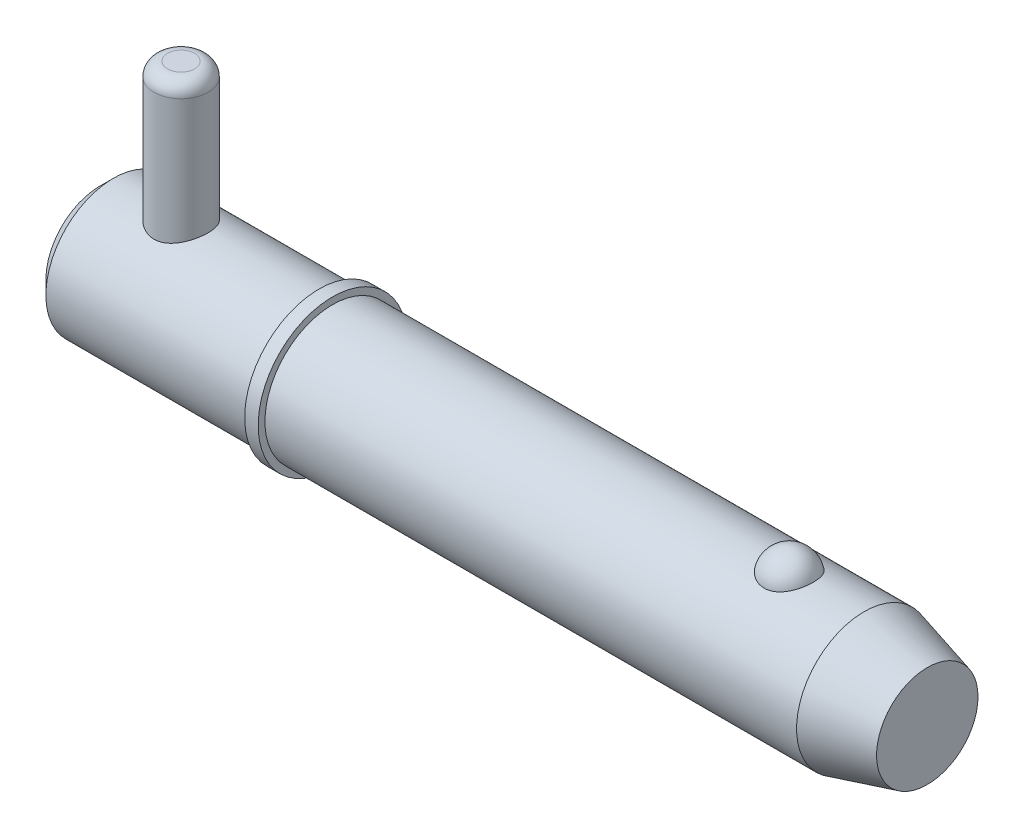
ISO-10303-21;
HEADER;
FILE_DESCRIPTION(('STEP AP214'),'2;1');
FILE_NAME('part.step','',(''),(''),'','','');
FILE_SCHEMA(('AUTOMOTIVE_DESIGN { 1 0 10303 214 1 1 1 1 }'));
ENDSEC;
DATA;
#1=APPLICATION_CONTEXT('core data for automotive mechanical design processes');
#2=APPLICATION_PROTOCOL_DEFINITION('international standard','automotive_design',2000,#1);
#3=PRODUCT_CONTEXT('',#1,'mechanical');
#4=PRODUCT('Part','Part','',(#3));
#5=PRODUCT_RELATED_PRODUCT_CATEGORY('part','',(#4));
#6=PRODUCT_DEFINITION_FORMATION('','',#4);
#7=PRODUCT_DEFINITION_CONTEXT('part definition',#1,'design');
#8=PRODUCT_DEFINITION('design','',#6,#7);
#9=PRODUCT_DEFINITION_SHAPE('','',#8);
#10=(LENGTH_UNIT() NAMED_UNIT(*) SI_UNIT(.MILLI.,.METRE.));
#11=(NAMED_UNIT(*) PLANE_ANGLE_UNIT() SI_UNIT($,.RADIAN.));
#12=(NAMED_UNIT(*) SI_UNIT($,.STERADIAN.) SOLID_ANGLE_UNIT());
#13=UNCERTAINTY_MEASURE_WITH_UNIT(LENGTH_MEASURE(1.E-05),#10,'distance_accuracy_value','');
#14=(GEOMETRIC_REPRESENTATION_CONTEXT(3) GLOBAL_UNCERTAINTY_ASSIGNED_CONTEXT((#13)) GLOBAL_UNIT_ASSIGNED_CONTEXT((#10,
#11,#12)) REPRESENTATION_CONTEXT('',''));
#15=CARTESIAN_POINT('',(0.,0.,0.));
#16=DIRECTION('',(0.,0.,1.));
#17=DIRECTION('',(1.,0.,0.));
#18=AXIS2_PLACEMENT_3D('',#15,#16,#17);
#19=CARTESIAN_POINT('',(9.525,23.81,0.));
#20=DIRECTION('',(0.,-1.,0.));
#21=DIRECTION('',(0.,0.,-1.));
#22=AXIS2_PLACEMENT_3D('',#19,#20,#21);
#23=CYLINDRICAL_SURFACE('',#22,3.175);
#24=CARTESIAN_POINT('',(9.525,-6.3525,0.));
#25=DIRECTION('',(0.,1.,0.));
#26=DIRECTION('',(0.,0.,1.));
#27=AXIS2_PLACEMENT_3D('',#24,#25,#26);
#28=CIRCLE('',#27,3.175);
#29=CARTESIAN_POINT('',(9.525,-6.3525,3.175));
#30=VERTEX_POINT('',#29);
#31=EDGE_CURVE('P0_E25',#30,#30,#28,.T.);
#32=ORIENTED_EDGE('',*,*,#31,.T.);
#33=EDGE_LOOP('',(#32));
#34=FACE_BOUND('',#33,.T.);
#35=CARTESIAN_POINT('',(9.525,22.2225,0.));
#36=DIRECTION('',(0.,1.,0.));
#37=DIRECTION('',(0.,0.,1.));
#38=AXIS2_PLACEMENT_3D('',#35,#36,#37);
#39=CIRCLE('',#38,3.175);
#40=CARTESIAN_POINT('',(9.525,22.2225,3.175));
#41=VERTEX_POINT('',#40);
#42=EDGE_CURVE('P0_E29',#41,#41,#39,.F.);
#43=ORIENTED_EDGE('',*,*,#42,.T.);
#44=EDGE_LOOP('',(#43));
#45=FACE_BOUND('',#44,.T.);
#46=ADVANCED_FACE('P0_F14',(#34,#45),#23,.T.);
#47=CARTESIAN_POINT('',(9.525,23.81,0.));
#48=DIRECTION('',(0.,1.,0.));
#49=DIRECTION('',(0.,0.,1.));
#50=AXIS2_PLACEMENT_3D('',#47,#48,#49);
#51=PLANE('',#50);
#52=CARTESIAN_POINT('',(9.525,23.81,0.));
#53=DIRECTION('',(0.,1.,0.));
#54=DIRECTION('',(0.,0.,1.));
#55=AXIS2_PLACEMENT_3D('',#52,#53,#54);
#56=CIRCLE('',#55,1.5875);
#57=CARTESIAN_POINT('',(9.525,23.81,1.5875));
#58=VERTEX_POINT('',#57);
#59=EDGE_CURVE('P0_E10',#58,#58,#56,.T.);
#60=ORIENTED_EDGE('',*,*,#59,.T.);
#61=EDGE_LOOP('',(#60));
#62=FACE_BOUND('',#61,.T.);
#63=ADVANCED_FACE('P0_F46',(#62),#51,.T.);
#64=CARTESIAN_POINT('',(9.525,-7.94,0.));
#65=DIRECTION('',(0.,1.,0.));
#66=DIRECTION('',(0.,0.,1.));
#67=AXIS2_PLACEMENT_3D('',#64,#65,#66);
#68=PLANE('',#67);
#69=CARTESIAN_POINT('',(9.525,-7.94,0.));
#70=DIRECTION('',(0.,1.,0.));
#71=DIRECTION('',(0.,0.,1.));
#72=AXIS2_PLACEMENT_3D('',#69,#70,#71);
#73=CIRCLE('',#72,1.5875);
#74=CARTESIAN_POINT('',(9.525,-7.94,1.5875));
#75=VERTEX_POINT('',#74);
#76=EDGE_CURVE('P0_E21',#75,#75,#73,.F.);
#77=ORIENTED_EDGE('',*,*,#76,.T.);
#78=EDGE_LOOP('',(#77));
#79=FACE_BOUND('',#78,.T.);
#80=ADVANCED_FACE('P0_F43',(#79),#68,.F.);
#81=CARTESIAN_POINT('',(9.525,-6.3525,0.));
#82=DIRECTION('',(0.,1.,0.));
#83=DIRECTION('',(0.,0.,1.));
#84=AXIS2_PLACEMENT_3D('',#81,#82,#83);
#85=DEGENERATE_TOROIDAL_SURFACE('',#84,1.5875,1.5875,.T.);
#86=ORIENTED_EDGE('',*,*,#76,.F.);
#87=EDGE_LOOP('',(#86));
#88=FACE_BOUND('',#87,.T.);
#89=ORIENTED_EDGE('',*,*,#31,.F.);
#90=EDGE_LOOP('',(#89));
#91=FACE_BOUND('',#90,.T.);
#92=ADVANCED_FACE('P0_F38',(#88,#91),#85,.T.);
#93=CARTESIAN_POINT('',(9.525,22.2225,0.));
#94=DIRECTION('',(0.,1.,0.));
#95=DIRECTION('',(0.,0.,1.));
#96=AXIS2_PLACEMENT_3D('',#93,#94,#95);
#97=DEGENERATE_TOROIDAL_SURFACE('',#96,1.5875,1.5875,.T.);
#98=ORIENTED_EDGE('',*,*,#42,.F.);
#99=EDGE_LOOP('',(#98));
#100=FACE_BOUND('',#99,.T.);
#101=ORIENTED_EDGE('',*,*,#59,.F.);
#102=EDGE_LOOP('',(#101));
#103=FACE_BOUND('',#102,.T.);
#104=ADVANCED_FACE('P0_F16',(#100,#103),#97,.T.);
#105=CLOSED_SHELL('',(#46,#63,#80,#92,#104));
#106=MANIFOLD_SOLID_BREP('P0_B1',#105);
#107=CARTESIAN_POINT('',(0.,0.,0.));
#108=DIRECTION('',(1.,0.,0.));
#109=DIRECTION('',(0.,0.,-1.));
#110=AXIS2_PLACEMENT_3D('',#107,#108,#109);
#111=CYLINDRICAL_SURFACE('',#110,7.94);
#112=CARTESIAN_POINT('',(89.7518791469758,0.,0.));
#113=DIRECTION('',(1.,0.,0.));
#114=DIRECTION('',(0.,0.,-1.));
#115=AXIS2_PLACEMENT_3D('',#112,#113,#114);
#116=CIRCLE('',#115,7.94);
#117=CARTESIAN_POINT('',(89.7518791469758,0.,-7.94));
#118=VERTEX_POINT('',#117);
#119=EDGE_CURVE('P1_E81',#118,#118,#116,.T.);
#120=ORIENTED_EDGE('',*,*,#119,.F.);
#121=EDGE_LOOP('',(#120));
#122=FACE_BOUND('',#121,.T.);
#123=CARTESIAN_POINT('',(27.31,0.,0.));
#124=DIRECTION('',(1.,0.,0.));
#125=DIRECTION('',(0.,0.,-1.));
#126=AXIS2_PLACEMENT_3D('',#123,#124,#125);
#127=CIRCLE('',#126,7.94);
#128=CARTESIAN_POINT('',(27.31,0.,-7.94));
#129=VERTEX_POINT('',#128);
#130=EDGE_CURVE('P1_E85',#129,#129,#127,.T.);
#131=ORIENTED_EDGE('',*,*,#130,.T.);
#132=EDGE_LOOP('',(#131));
#133=FACE_BOUND('',#132,.T.);
#134=CARTESIAN_POINT('',(80.9449074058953,7.37767842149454,2.93486986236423));
#135=CARTESIAN_POINT('',(80.7927496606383,7.3776732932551,2.93487505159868));
#136=CARTESIAN_POINT('',(80.6406329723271,7.38258419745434,2.92262454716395));
#137=CARTESIAN_POINT('',(80.3409284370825,7.40163229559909,2.87404196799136));
#138=CARTESIAN_POINT('',(80.1933394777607,7.41576720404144,2.83771585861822));
#139=CARTESIAN_POINT('',(79.9070187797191,7.4516157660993,2.74218769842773));
#140=CARTESIAN_POINT('',(79.7682745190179,7.47331841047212,2.68301886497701));
#141=CARTESIAN_POINT('',(79.5028822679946,7.52194082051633,2.54350967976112));
#142=CARTESIAN_POINT('',(79.3762366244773,7.5488615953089,2.46316523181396));
#143=CARTESIAN_POINT('',(79.1345349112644,7.60594671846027,2.28090375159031));
#144=CARTESIAN_POINT('',(79.0199065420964,7.63618114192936,2.17844211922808));
#145=CARTESIAN_POINT('',(78.8088787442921,7.69614046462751,1.95608495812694));
#146=CARTESIAN_POINT('',(78.7124826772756,7.72586526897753,1.83618622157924));
#147=CARTESIAN_POINT('',(78.5359381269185,7.78314821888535,1.57628086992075));
#148=CARTESIAN_POINT('',(78.4567072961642,7.81055035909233,1.43561546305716));
#149=CARTESIAN_POINT('',(78.3217979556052,7.85879631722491,1.14236334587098));
#150=CARTESIAN_POINT('',(78.2661216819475,7.87963951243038,0.989775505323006));
#151=CARTESIAN_POINT('',(78.1788121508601,7.91289645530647,0.67461992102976));
#152=CARTESIAN_POINT('',(78.1475309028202,7.925186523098,0.511941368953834));
#153=CARTESIAN_POINT('',(78.110975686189,7.93958930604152,0.183247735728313));
#154=CARTESIAN_POINT('',(78.1057012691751,7.94170219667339,0.0172327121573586));
#155=CARTESIAN_POINT('',(78.1212311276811,7.93554931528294,-0.312672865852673));
#156=CARTESIAN_POINT('',(78.1419253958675,7.92732732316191,-0.476569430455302));
#157=CARTESIAN_POINT('',(78.2087865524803,7.90141534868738,-0.798305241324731));
#158=CARTESIAN_POINT('',(78.2549539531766,7.88372517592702,-0.956144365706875));
#159=CARTESIAN_POINT('',(78.3718986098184,7.84066230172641,-1.26152073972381));
#160=CARTESIAN_POINT('',(78.4427046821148,7.81528060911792,-1.40904568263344));
#161=CARTESIAN_POINT('',(78.6074789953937,7.7594867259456,-1.68950598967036));
#162=CARTESIAN_POINT('',(78.7014488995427,7.72907417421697,-1.82244030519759));
#163=CARTESIAN_POINT('',(78.9108391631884,7.66640424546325,-2.07032792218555));
#164=CARTESIAN_POINT('',(79.0263152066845,7.63414223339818,-2.1852330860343));
#165=CARTESIAN_POINT('',(79.2759006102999,7.57149681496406,-2.39329737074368));
#166=CARTESIAN_POINT('',(79.4100080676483,7.54111321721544,-2.48645870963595));
#167=CARTESIAN_POINT('',(79.6901113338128,7.48650742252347,-2.64628132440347));
#168=CARTESIAN_POINT('',(79.8357605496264,7.46215900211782,-2.71350554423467));
#169=CARTESIAN_POINT('',(80.1374259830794,7.42171253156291,-2.82226614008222));
#170=CARTESIAN_POINT('',(80.2934383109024,7.40561140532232,-2.86381209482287));
#171=CARTESIAN_POINT('',(80.6029708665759,7.3842679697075,-2.91839077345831));
#172=CARTESIAN_POINT('',(80.7562229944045,7.37852109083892,-2.93275024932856));
#173=CARTESIAN_POINT('',(81.0630705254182,7.37700973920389,-2.93655208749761));
#174=CARTESIAN_POINT('',(81.2166658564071,7.38124333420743,-2.92599927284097));
#175=CARTESIAN_POINT('',(81.5149907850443,7.39890635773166,-2.88102897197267));
#176=CARTESIAN_POINT('',(81.6598480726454,7.41205491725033,-2.8473399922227));
#177=CARTESIAN_POINT('',(81.9416432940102,7.445801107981,-2.75788206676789));
#178=CARTESIAN_POINT('',(82.0785805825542,7.46639934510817,-2.70211132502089));
#179=CARTESIAN_POINT('',(82.3440619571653,7.51339098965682,-2.56858908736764));
#180=CARTESIAN_POINT('',(82.4723548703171,7.53990200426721,-2.49038067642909));
#181=CARTESIAN_POINT('',(82.7142440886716,7.59569503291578,-2.31462737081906));
#182=CARTESIAN_POINT('',(82.8278370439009,7.62497767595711,-2.21707808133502));
#183=CARTESIAN_POINT('',(83.04322156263,7.68489473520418,-1.99982049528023));
#184=CARTESIAN_POINT('',(83.1441488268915,7.71552419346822,-1.87925337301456));
#185=CARTESIAN_POINT('',(83.3251866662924,7.77353016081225,-1.62268826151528));
#186=CARTESIAN_POINT('',(83.4052934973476,7.80090608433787,-1.4866875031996));
#187=CARTESIAN_POINT('',(83.5453615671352,7.85047992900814,-1.19818413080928));
#188=CARTESIAN_POINT('',(83.6045877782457,7.8724818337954,-1.04529016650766));
#189=CARTESIAN_POINT('',(83.6979821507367,7.90785114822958,-0.731080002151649));
#190=CARTESIAN_POINT('',(83.7321497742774,7.92121837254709,-0.569763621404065));
#191=CARTESIAN_POINT('',(83.774795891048,7.93797834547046,-0.242812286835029));
#192=CARTESIAN_POINT('',(83.7832047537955,7.94134405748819,-0.0771668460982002));
#193=CARTESIAN_POINT('',(83.7739626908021,7.93767937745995,0.2532769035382));
#194=CARTESIAN_POINT('',(83.7563120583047,7.93064910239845,0.418075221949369));
#195=CARTESIAN_POINT('',(83.6954247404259,7.90695571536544,0.741525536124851));
#196=CARTESIAN_POINT('',(83.6522819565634,7.8903279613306,0.900197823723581));
#197=CARTESIAN_POINT('',(83.5413535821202,7.84916386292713,1.20759654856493));
#198=CARTESIAN_POINT('',(83.47356656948,7.82462706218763,1.35632241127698));
#199=CARTESIAN_POINT('',(83.3143718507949,7.7700669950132,1.64032869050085));
#200=CARTESIAN_POINT('',(83.2228616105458,7.7400200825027,1.77554712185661));
#201=CARTESIAN_POINT('',(83.0182960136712,7.67774175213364,2.02800648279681));
#202=CARTESIAN_POINT('',(82.9052410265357,7.64551037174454,2.14524772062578));
#203=CARTESIAN_POINT('',(82.6608318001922,7.58265895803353,2.35778002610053));
#204=CARTESIAN_POINT('',(82.5295833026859,7.5520309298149,2.45319004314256));
#205=CARTESIAN_POINT('',(82.251601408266,7.49579792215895,2.61999897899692));
#206=CARTESIAN_POINT('',(82.1048670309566,7.47019326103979,2.69139637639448));
#207=CARTESIAN_POINT('',(81.7929477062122,7.42622216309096,2.8105324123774));
#208=CARTESIAN_POINT('',(81.6272209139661,7.40825002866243,2.85700910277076));
#209=CARTESIAN_POINT('',(81.2892792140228,7.38398348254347,2.9191685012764));
#210=CARTESIAN_POINT('',(81.1170670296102,7.3776842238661,2.93486399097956));
#211=CARTESIAN_POINT('',(80.9449074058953,7.37767842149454,2.93486986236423));
#212=B_SPLINE_CURVE_WITH_KNOTS('',3,(#134,#135,#136,#137,#138,#139,#140,#141,#142,#143,#144,
#145,#146,#147,#148,#149,#150,#151,#152,#153,#154,#155,#156,#157,#158,#159,#160,#161,#162,#163,
#164,#165,#166,#167,#168,#169,#170,#171,#172,#173,#174,#175,#176,#177,#178,#179,#180,#181,#182,
#183,#184,#185,#186,#187,#188,#189,#190,#191,#192,#193,#194,#195,#196,#197,#198,#199,#200,#201,
#202,#203,#204,#205,#206,#207,#208,#209,#210,#211),.UNSPECIFIED.,.T.,.F.,(4,2,2,2,2,2,2,2,2,2,2,
2,2,2,2,2,2,2,2,2,2,2,2,2,2,2,2,2,2,2,2,2,2,2,2,2,2,2,4),(0.,0.45584132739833,0.911569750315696,
1.36663794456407,1.8217942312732,2.28978983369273,2.7578716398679,3.246853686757,
3.73588214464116,4.23184282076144,4.72779494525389,5.22165321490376,5.71552141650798,
6.20996917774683,6.70445245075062,7.20023431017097,7.69596557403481,8.18023418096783,
8.66432203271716,9.12410697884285,9.58380291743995,10.0296503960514,10.4755341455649,
10.9312349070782,11.3870393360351,11.8654416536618,12.3439299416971,12.8378875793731,
13.3318558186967,13.8271581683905,14.3224549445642,14.8159385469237,15.3094506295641,
15.8051323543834,16.3008055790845,16.7937101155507,17.2866458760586,17.8026240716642,
18.3183879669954),.UNSPECIFIED.);
#213=CARTESIAN_POINT('',(80.9449074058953,7.37767842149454,2.93486986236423));
#214=VERTEX_POINT('',#213);
#215=EDGE_CURVE('P1_E35',#214,#214,#212,.T.);
#216=ORIENTED_EDGE('',*,*,#215,.T.);
#217=EDGE_LOOP('',(#216));
#218=FACE_BOUND('',#217,.T.);
#219=ADVANCED_FACE('P1_F13',(#122,#133,#218),#111,.T.);
#220=CARTESIAN_POINT('',(0.,0.,0.));
#221=DIRECTION('',(-1.,0.,0.));
#222=DIRECTION('',(0.,0.,1.));
#223=AXIS2_PLACEMENT_3D('',#220,#221,#222);
#224=PLANE('',#223);
#225=CARTESIAN_POINT('',(0.,0.,0.));
#226=DIRECTION('',(1.,0.,0.));
#227=DIRECTION('',(0.,0.,-1.));
#228=AXIS2_PLACEMENT_3D('',#225,#226,#227);
#229=CIRCLE('',#228,6.352);
#230=CARTESIAN_POINT('',(0.,0.,-6.352));
#231=VERTEX_POINT('',#230);
#232=EDGE_CURVE('P1_E9',#231,#231,#229,.T.);
#233=ORIENTED_EDGE('',*,*,#232,.F.);
#234=EDGE_LOOP('',(#233));
#235=FACE_BOUND('',#234,.T.);
#236=ADVANCED_FACE('P1_F15',(#235),#224,.T.);
#237=CARTESIAN_POINT('',(1.58799999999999,0.,0.));
#238=DIRECTION('',(1.,0.,0.));
#239=DIRECTION('',(0.,0.,-1.));
#240=AXIS2_PLACEMENT_3D('',#237,#238,#239);
#241=CONICAL_SURFACE('',#240,7.94,0.78539816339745);
#242=ORIENTED_EDGE('',*,*,#232,.T.);
#243=EDGE_LOOP('',(#242));
#244=FACE_BOUND('',#243,.T.);
#245=CARTESIAN_POINT('',(1.58799999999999,0.,0.));
#246=DIRECTION('',(1.,0.,0.));
#247=DIRECTION('',(0.,0.,-1.));
#248=AXIS2_PLACEMENT_3D('',#245,#246,#247);
#249=CIRCLE('',#248,7.94);
#250=CARTESIAN_POINT('',(1.58799999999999,0.,-7.94));
#251=VERTEX_POINT('',#250);
#252=EDGE_CURVE('P1_E26',#251,#251,#249,.T.);
#253=ORIENTED_EDGE('',*,*,#252,.F.);
#254=EDGE_LOOP('',(#253));
#255=FACE_BOUND('',#254,.T.);
#256=ADVANCED_FACE('P1_F77',(#244,#255),#241,.T.);
#257=CARTESIAN_POINT('',(0.,0.,0.));
#258=DIRECTION('',(1.,0.,0.));
#259=DIRECTION('',(0.,0.,-1.));
#260=AXIS2_PLACEMENT_3D('',#257,#258,#259);
#261=CYLINDRICAL_SURFACE('',#260,7.94);
#262=CARTESIAN_POINT('',(9.525,-7.27756655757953,3.175));
#263=CARTESIAN_POINT('',(9.43992346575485,-7.27756715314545,3.17499935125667));
#264=CARTESIAN_POINT('',(9.35481882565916,-7.27906496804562,3.1715736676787));
#265=CARTESIAN_POINT('',(9.18524505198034,-7.28499816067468,3.15791803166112));
#266=CARTESIAN_POINT('',(9.100776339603,-7.28943533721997,3.14768391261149));
#267=CARTESIAN_POINT('',(8.84895715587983,-7.30698881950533,3.10684226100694));
#268=CARTESIAN_POINT('',(8.6834173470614,-7.32434654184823,3.06609574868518));
#269=CARTESIAN_POINT('',(8.36278910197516,-7.36806950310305,2.95945910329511));
#270=CARTESIAN_POINT('',(8.20766386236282,-7.39440078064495,2.89366366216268));
#271=CARTESIAN_POINT('',(7.91065319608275,-7.45304562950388,2.73907413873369));
#272=CARTESIAN_POINT('',(7.76876488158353,-7.48535789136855,2.65028508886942));
#273=CARTESIAN_POINT('',(7.49411086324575,-7.55439482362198,2.44679888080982));
#274=CARTESIAN_POINT('',(7.36219910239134,-7.59126138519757,2.33099745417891));
#275=CARTESIAN_POINT('',(7.11904234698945,-7.66408045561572,2.07909838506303));
#276=CARTESIAN_POINT('',(7.00780457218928,-7.70003264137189,1.94299368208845));
#277=CARTESIAN_POINT('',(6.80492173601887,-7.76867514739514,1.64775981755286));
#278=CARTESIAN_POINT('',(6.71422139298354,-7.80118112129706,1.48793473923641));
#279=CARTESIAN_POINT('',(6.56135788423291,-7.85754918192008,1.15376269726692));
#280=CARTESIAN_POINT('',(6.49918311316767,-7.88141478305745,0.979421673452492));
#281=CARTESIAN_POINT('',(6.40818142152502,-7.91680873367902,0.630115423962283));
#282=CARTESIAN_POINT('',(6.3778864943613,-7.9288781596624,0.455588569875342));
#283=CARTESIAN_POINT('',(6.34677743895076,-7.94127547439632,0.103539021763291));
#284=CARTESIAN_POINT('',(6.34595232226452,-7.94160773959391,-0.0739825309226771));
#285=CARTESIAN_POINT('',(6.37300128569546,-7.93082261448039,-0.416371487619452));
#286=CARTESIAN_POINT('',(6.39926693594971,-7.92034690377,-0.581389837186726));
#287=CARTESIAN_POINT('',(6.47701615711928,-7.88998770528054,-0.904449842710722));
#288=CARTESIAN_POINT('',(6.52850157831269,-7.87010352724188,-1.06249098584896));
#289=CARTESIAN_POINT('',(6.65586120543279,-7.82249343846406,-1.36995769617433));
#290=CARTESIAN_POINT('',(6.73209124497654,-7.79465387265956,-1.51921754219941));
#291=CARTESIAN_POINT('',(6.90644286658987,-7.73389606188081,-1.80321183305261));
#292=CARTESIAN_POINT('',(7.00457194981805,-7.70097607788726,-1.93794127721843));
#293=CARTESIAN_POINT('',(7.22744086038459,-7.63084889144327,-2.19843606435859));
#294=CARTESIAN_POINT('',(7.35350432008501,-7.59350211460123,-2.3230330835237));
#295=CARTESIAN_POINT('',(7.62488266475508,-7.52039654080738,-2.54979642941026));
#296=CARTESIAN_POINT('',(7.77020381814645,-7.48463826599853,-2.65195542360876));
#297=CARTESIAN_POINT('',(8.08119298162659,-7.41780943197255,-2.83361305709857));
#298=CARTESIAN_POINT('',(8.24731937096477,-7.38689959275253,-2.91239105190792));
#299=CARTESIAN_POINT('',(8.59204539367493,-7.33515216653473,-3.04038913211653));
#300=CARTESIAN_POINT('',(8.77063684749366,-7.31430804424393,-3.08962840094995));
#301=CARTESIAN_POINT('',(9.12356982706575,-7.28663831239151,-3.15431018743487));
#302=CARTESIAN_POINT('',(9.29750494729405,-7.2790344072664,-3.17163284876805));
#303=CARTESIAN_POINT('',(9.64592502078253,-7.27648884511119,-3.17747282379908));
#304=CARTESIAN_POINT('',(9.82040979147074,-7.28154335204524,-3.16599886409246));
#305=CARTESIAN_POINT('',(10.1545374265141,-7.30294638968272,-3.11628310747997));
#306=CARTESIAN_POINT('',(10.3144598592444,-7.31863587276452,-3.0796016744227));
#307=CARTESIAN_POINT('',(10.625774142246,-7.35872371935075,-2.98253618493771));
#308=CARTESIAN_POINT('',(10.7771640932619,-7.38312401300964,-2.92214687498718));
#309=CARTESIAN_POINT('',(11.0739599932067,-7.4390944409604,-2.77664664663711));
#310=CARTESIAN_POINT('',(11.2188745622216,-7.47091513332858,-2.69063278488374));
#311=CARTESIAN_POINT('',(11.4928722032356,-7.53775867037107,-2.49724834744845));
#312=CARTESIAN_POINT('',(11.6219487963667,-7.57278281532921,-2.38986907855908));
#313=CARTESIAN_POINT('',(11.8705091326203,-7.64520845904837,-2.1474449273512));
#314=CARTESIAN_POINT('',(11.9885816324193,-7.68259462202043,-2.01094304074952));
#315=CARTESIAN_POINT('',(12.2003631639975,-7.75309951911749,-1.71917041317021));
#316=CARTESIAN_POINT('',(12.2940712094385,-7.78621808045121,-1.56389891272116));
#317=CARTESIAN_POINT('',(12.4541161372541,-7.84456050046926,-1.23845027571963));
#318=CARTESIAN_POINT('',(12.5204600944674,-7.86978639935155,-1.06827700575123));
#319=CARTESIAN_POINT('',(12.6231407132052,-7.90943635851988,-0.717928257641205));
#320=CARTESIAN_POINT('',(12.6594936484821,-7.92386627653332,-0.537758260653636));
#321=CARTESIAN_POINT('',(12.6992281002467,-7.93967263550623,-0.185201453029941));
#322=CARTESIAN_POINT('',(12.7046050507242,-7.94183891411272,-0.0130732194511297));
#323=CARTESIAN_POINT('',(12.6875036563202,-7.9350072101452,0.329549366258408));
#324=CARTESIAN_POINT('',(12.6650295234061,-7.92601091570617,0.500043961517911));
#325=CARTESIAN_POINT('',(12.5942896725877,-7.89825976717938,0.829196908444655));
#326=CARTESIAN_POINT('',(12.5468364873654,-7.87981280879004,0.988057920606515));
#327=CARTESIAN_POINT('',(12.4283390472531,-7.83513565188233,1.29553461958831));
#328=CARTESIAN_POINT('',(12.3572904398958,-7.8089040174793,1.44414841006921));
#329=CARTESIAN_POINT('',(12.1900822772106,-7.7497911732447,1.73412879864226));
#330=CARTESIAN_POINT('',(12.0929519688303,-7.71666737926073,1.87488510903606));
#331=CARTESIAN_POINT('',(11.8777894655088,-7.64775894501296,2.13869231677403));
#332=CARTESIAN_POINT('',(11.7597486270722,-7.61197320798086,2.26173585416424));
#333=CARTESIAN_POINT('',(11.4974896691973,-7.53902341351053,2.49449755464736));
#334=CARTESIAN_POINT('',(11.3521039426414,-7.50191102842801,2.60292060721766));
#335=CARTESIAN_POINT('',(11.0440201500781,-7.43289551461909,2.79392602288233));
#336=CARTESIAN_POINT('',(10.8813200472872,-7.40099299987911,2.87650534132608));
#337=CARTESIAN_POINT('',(10.558064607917,-7.3489506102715,3.00682739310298));
#338=CARTESIAN_POINT('',(10.398627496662,-7.32801197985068,3.05703164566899));
#339=CARTESIAN_POINT('',(10.0731242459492,-7.29639491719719,3.13175843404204));
#340=CARTESIAN_POINT('',(9.90707793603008,-7.28568789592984,3.15635254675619));
#341=CARTESIAN_POINT('',(9.70441566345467,-7.27968826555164,3.17013149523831));
#342=CARTESIAN_POINT('',(9.66856669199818,-7.27889378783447,3.17195593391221));
#343=CARTESIAN_POINT('',(9.59681348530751,-7.27783278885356,3.17439036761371));
#344=CARTESIAN_POINT('',(9.56090924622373,-7.27756630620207,3.17500027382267));
#345=CARTESIAN_POINT('',(9.525,-7.27756655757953,3.175));
#346=B_SPLINE_CURVE_WITH_KNOTS('',3,(#262,#263,#264,#265,#266,#267,#268,#269,#270,#271,#272,
#273,#274,#275,#276,#277,#278,#279,#280,#281,#282,#283,#284,#285,#286,#287,#288,#289,#290,#291,
#292,#293,#294,#295,#296,#297,#298,#299,#300,#301,#302,#303,#304,#305,#306,#307,#308,#309,#310,
#311,#312,#313,#314,#315,#316,#317,#318,#319,#320,#321,#322,#323,#324,#325,#326,#327,#328,#329,
#330,#331,#332,#333,#334,#335,#336,#337,#338,#339,#340,#341,#342,#343,#344,#345),.UNSPECIFIED.,
.T.,.F.,(4,2,2,2,2,2,2,2,2,2,2,2,2,2,2,2,2,2,2,2,2,2,2,2,2,2,2,2,2,2,2,2,2,2,2,2,2,2,2,2,2,4),
(0.,0.255187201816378,0.510530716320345,1.0218798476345,1.53131482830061,2.04063840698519,
2.57635929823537,3.11226692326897,3.66929090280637,4.22608806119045,4.75594400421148,
5.28560237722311,5.78552836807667,6.28549104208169,6.79298787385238,7.30065880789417,
7.8416422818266,8.38280228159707,8.93923025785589,9.49529647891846,10.0174074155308,
10.5393601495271,11.0316114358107,11.5239718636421,12.0362920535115,12.5488211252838,
13.0991799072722,13.6495609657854,14.1997996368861,14.7497395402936,15.2638187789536,
15.7778202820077,16.2760504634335,16.7743726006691,17.294711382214,17.8152657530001,
18.3680208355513,18.9208410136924,19.4240423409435,19.9258334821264,20.0335354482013,
20.1412452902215),.UNSPECIFIED.);
#347=CARTESIAN_POINT('',(9.525,-7.27756655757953,3.175));
#348=VERTEX_POINT('',#347);
#349=EDGE_CURVE('P1_E17',#348,#348,#346,.T.);
#350=ORIENTED_EDGE('',*,*,#349,.F.);
#351=EDGE_LOOP('',(#350));
#352=FACE_BOUND('',#351,.T.);
#353=CARTESIAN_POINT('',(9.525,7.27756655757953,3.175));
#354=CARTESIAN_POINT('',(9.61007653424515,7.27756715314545,3.17499935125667));
#355=CARTESIAN_POINT('',(9.69518117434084,7.27906496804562,3.1715736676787));
#356=CARTESIAN_POINT('',(9.86475494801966,7.28499816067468,3.15791803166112));
#357=CARTESIAN_POINT('',(9.949223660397,7.28943533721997,3.14768391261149));
#358=CARTESIAN_POINT('',(10.2010428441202,7.30698881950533,3.10684226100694));
#359=CARTESIAN_POINT('',(10.3665826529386,7.32434654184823,3.06609574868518));
#360=CARTESIAN_POINT('',(10.6872108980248,7.36806950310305,2.95945910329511));
#361=CARTESIAN_POINT('',(10.8423361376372,7.39440078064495,2.89366366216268));
#362=CARTESIAN_POINT('',(11.1393468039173,7.45304562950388,2.73907413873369));
#363=CARTESIAN_POINT('',(11.2812351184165,7.48535789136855,2.65028508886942));
#364=CARTESIAN_POINT('',(11.5558891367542,7.55439482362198,2.44679888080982));
#365=CARTESIAN_POINT('',(11.6878008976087,7.59126138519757,2.33099745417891));
#366=CARTESIAN_POINT('',(11.9309576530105,7.66408045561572,2.07909838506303));
#367=CARTESIAN_POINT('',(12.0421954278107,7.70003264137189,1.94299368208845));
#368=CARTESIAN_POINT('',(12.2450782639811,7.76867514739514,1.64775981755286));
#369=CARTESIAN_POINT('',(12.3357786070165,7.80118112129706,1.48793473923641));
#370=CARTESIAN_POINT('',(12.4886421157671,7.85754918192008,1.15376269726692));
#371=CARTESIAN_POINT('',(12.5508168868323,7.88141478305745,0.979421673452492));
#372=CARTESIAN_POINT('',(12.641818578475,7.91680873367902,0.630115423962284));
#373=CARTESIAN_POINT('',(12.6721135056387,7.9288781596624,0.455588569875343));
#374=CARTESIAN_POINT('',(12.7032225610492,7.94127547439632,0.103539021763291));
#375=CARTESIAN_POINT('',(12.7040476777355,7.94160773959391,-0.0739825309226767));
#376=CARTESIAN_POINT('',(12.6769987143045,7.93082261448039,-0.416371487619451));
#377=CARTESIAN_POINT('',(12.6507330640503,7.92034690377,-0.581389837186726));
#378=CARTESIAN_POINT('',(12.5729838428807,7.88998770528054,-0.904449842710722));
#379=CARTESIAN_POINT('',(12.5214984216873,7.87010352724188,-1.06249098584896));
#380=CARTESIAN_POINT('',(12.3941387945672,7.82249343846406,-1.36995769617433));
#381=CARTESIAN_POINT('',(12.3179087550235,7.79465387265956,-1.51921754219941));
#382=CARTESIAN_POINT('',(12.1435571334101,7.73389606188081,-1.80321183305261));
#383=CARTESIAN_POINT('',(12.0454280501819,7.70097607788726,-1.93794127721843));
#384=CARTESIAN_POINT('',(11.8225591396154,7.63084889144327,-2.19843606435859));
#385=CARTESIAN_POINT('',(11.696495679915,7.59350211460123,-2.3230330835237));
#386=CARTESIAN_POINT('',(11.4251173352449,7.52039654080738,-2.54979642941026));
#387=CARTESIAN_POINT('',(11.2797961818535,7.48463826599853,-2.65195542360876));
#388=CARTESIAN_POINT('',(10.9688070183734,7.41780943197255,-2.83361305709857));
#389=CARTESIAN_POINT('',(10.8026806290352,7.38689959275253,-2.91239105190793));
#390=CARTESIAN_POINT('',(10.4579546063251,7.33515216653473,-3.04038913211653));
#391=CARTESIAN_POINT('',(10.2793631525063,7.31430804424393,-3.08962840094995));
#392=CARTESIAN_POINT('',(9.92643017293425,7.28663831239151,-3.15431018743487));
#393=CARTESIAN_POINT('',(9.75249505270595,7.2790344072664,-3.17163284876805));
#394=CARTESIAN_POINT('',(9.40407497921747,7.2764888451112,-3.17747282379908));
#395=CARTESIAN_POINT('',(9.22959020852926,7.28154335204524,-3.16599886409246));
#396=CARTESIAN_POINT('',(8.89546257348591,7.30294638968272,-3.11628310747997));
#397=CARTESIAN_POINT('',(8.73554014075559,7.31863587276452,-3.0796016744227));
#398=CARTESIAN_POINT('',(8.42422585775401,7.35872371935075,-2.98253618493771));
#399=CARTESIAN_POINT('',(8.27283590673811,7.38312401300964,-2.92214687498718));
#400=CARTESIAN_POINT('',(7.97604000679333,7.4390944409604,-2.77664664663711));
#401=CARTESIAN_POINT('',(7.83112543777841,7.47091513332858,-2.69063278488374));
#402=CARTESIAN_POINT('',(7.55712779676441,7.53775867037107,-2.49724834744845));
#403=CARTESIAN_POINT('',(7.42805120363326,7.57278281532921,-2.38986907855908));
#404=CARTESIAN_POINT('',(7.17949086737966,7.64520845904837,-2.1474449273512));
#405=CARTESIAN_POINT('',(7.06141836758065,7.68259462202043,-2.01094304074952));
#406=CARTESIAN_POINT('',(6.8496368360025,7.75309951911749,-1.71917041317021));
#407=CARTESIAN_POINT('',(6.75592879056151,7.78621808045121,-1.56389891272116));
#408=CARTESIAN_POINT('',(6.59588386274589,7.84456050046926,-1.23845027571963));
#409=CARTESIAN_POINT('',(6.52953990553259,7.86978639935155,-1.06827700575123));
#410=CARTESIAN_POINT('',(6.42685928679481,7.90943635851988,-0.717928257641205));
#411=CARTESIAN_POINT('',(6.39050635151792,7.92386627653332,-0.537758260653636));
#412=CARTESIAN_POINT('',(6.35077189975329,7.93967263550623,-0.18520145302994));
#413=CARTESIAN_POINT('',(6.34539494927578,7.94183891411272,-0.0130732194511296));
#414=CARTESIAN_POINT('',(6.36249634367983,7.9350072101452,0.329549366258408));
#415=CARTESIAN_POINT('',(6.38497047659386,7.92601091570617,0.500043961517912));
#416=CARTESIAN_POINT('',(6.45571032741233,7.89825976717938,0.829196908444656));
#417=CARTESIAN_POINT('',(6.50316351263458,7.87981280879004,0.988057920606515));
#418=CARTESIAN_POINT('',(6.62166095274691,7.83513565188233,1.29553461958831));
#419=CARTESIAN_POINT('',(6.69270956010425,7.8089040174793,1.44414841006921));
#420=CARTESIAN_POINT('',(6.85991772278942,7.7497911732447,1.73412879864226));
#421=CARTESIAN_POINT('',(6.95704803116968,7.71666737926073,1.87488510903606));
#422=CARTESIAN_POINT('',(7.17221053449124,7.64775894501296,2.13869231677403));
#423=CARTESIAN_POINT('',(7.29025137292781,7.61197320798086,2.26173585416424));
#424=CARTESIAN_POINT('',(7.55251033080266,7.53902341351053,2.49449755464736));
#425=CARTESIAN_POINT('',(7.69789605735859,7.50191102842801,2.60292060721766));
#426=CARTESIAN_POINT('',(8.00597984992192,7.43289551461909,2.79392602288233));
#427=CARTESIAN_POINT('',(8.16867995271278,7.40099299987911,2.87650534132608));
#428=CARTESIAN_POINT('',(8.49193539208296,7.3489506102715,3.00682739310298));
#429=CARTESIAN_POINT('',(8.65137250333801,7.32801197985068,3.05703164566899));
#430=CARTESIAN_POINT('',(8.97687575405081,7.29639491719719,3.13175843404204));
#431=CARTESIAN_POINT('',(9.14292206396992,7.28568789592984,3.15635254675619));
#432=CARTESIAN_POINT('',(9.34558433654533,7.27968826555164,3.17013149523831));
#433=CARTESIAN_POINT('',(9.38143330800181,7.27889378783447,3.17195593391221));
#434=CARTESIAN_POINT('',(9.45318651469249,7.27783278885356,3.17439036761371));
#435=CARTESIAN_POINT('',(9.48909075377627,7.27756630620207,3.17500027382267));
#436=CARTESIAN_POINT('',(9.525,7.27756655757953,3.175));
#437=B_SPLINE_CURVE_WITH_KNOTS('',3,(#353,#354,#355,#356,#357,#358,#359,#360,#361,#362,#363,
#364,#365,#366,#367,#368,#369,#370,#371,#372,#373,#374,#375,#376,#377,#378,#379,#380,#381,#382,
#383,#384,#385,#386,#387,#388,#389,#390,#391,#392,#393,#394,#395,#396,#397,#398,#399,#400,#401,
#402,#403,#404,#405,#406,#407,#408,#409,#410,#411,#412,#413,#414,#415,#416,#417,#418,#419,#420,
#421,#422,#423,#424,#425,#426,#427,#428,#429,#430,#431,#432,#433,#434,#435,#436),.UNSPECIFIED.,
.T.,.F.,(4,2,2,2,2,2,2,2,2,2,2,2,2,2,2,2,2,2,2,2,2,2,2,2,2,2,2,2,2,2,2,2,2,2,2,2,2,2,2,2,2,4),
(0.,0.255187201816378,0.510530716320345,1.0218798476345,1.53131482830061,2.04063840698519,
2.57635929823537,3.11226692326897,3.66929090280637,4.22608806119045,4.75594400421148,
5.2856023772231,5.78552836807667,6.28549104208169,6.79298787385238,7.30065880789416,
7.8416422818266,8.38280228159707,8.9392302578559,9.49529647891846,10.0174074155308,
10.5393601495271,11.0316114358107,11.5239718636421,12.0362920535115,12.5488211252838,
13.0991799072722,13.6495609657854,14.1997996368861,14.7497395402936,15.2638187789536,
15.7778202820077,16.2760504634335,16.7743726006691,17.294711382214,17.8152657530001,
18.3680208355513,18.9208410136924,19.4240423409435,19.9258334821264,20.0335354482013,
20.1412452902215),.UNSPECIFIED.);
#438=CARTESIAN_POINT('',(9.525,7.27756655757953,3.175));
#439=VERTEX_POINT('',#438);
#440=EDGE_CURVE('P1_E43',#439,#439,#437,.T.);
#441=ORIENTED_EDGE('',*,*,#440,.F.);
#442=EDGE_LOOP('',(#441));
#443=FACE_BOUND('',#442,.T.);
#444=ORIENTED_EDGE('',*,*,#252,.T.);
#445=EDGE_LOOP('',(#444));
#446=FACE_BOUND('',#445,.T.);
#447=CARTESIAN_POINT('',(25.722,0.,0.));
#448=DIRECTION('',(1.,0.,0.));
#449=DIRECTION('',(0.,0.,-1.));
#450=AXIS2_PLACEMENT_3D('',#447,#448,#449);
#451=CIRCLE('',#450,7.94);
#452=CARTESIAN_POINT('',(25.722,0.,-7.94));
#453=VERTEX_POINT('',#452);
#454=EDGE_CURVE('P1_E31',#453,#453,#451,.T.);
#455=ORIENTED_EDGE('',*,*,#454,.F.);
#456=EDGE_LOOP('',(#455));
#457=FACE_BOUND('',#456,.T.);
#458=ADVANCED_FACE('P1_F103',(#352,#443,#446,#457),#261,.T.);
#459=CARTESIAN_POINT('',(25.722,7.94,0.));
#460=DIRECTION('',(-1.,0.,0.));
#461=DIRECTION('',(0.,0.,1.));
#462=AXIS2_PLACEMENT_3D('',#459,#460,#461);
#463=PLANE('',#462);
#464=ORIENTED_EDGE('',*,*,#454,.T.);
#465=EDGE_LOOP('',(#464));
#466=FACE_BOUND('',#465,.T.);
#467=CARTESIAN_POINT('',(25.722,0.,0.));
#468=DIRECTION('',(1.,0.,0.));
#469=DIRECTION('',(0.,0.,-1.));
#470=AXIS2_PLACEMENT_3D('',#467,#468,#469);
#471=CIRCLE('',#470,8.734);
#472=CARTESIAN_POINT('',(25.722,0.,-8.734));
#473=VERTEX_POINT('',#472);
#474=EDGE_CURVE('P1_E91',#473,#473,#471,.T.);
#475=ORIENTED_EDGE('',*,*,#474,.F.);
#476=EDGE_LOOP('',(#475));
#477=FACE_BOUND('',#476,.T.);
#478=ADVANCED_FACE('P1_F100',(#466,#477),#463,.T.);
#479=CARTESIAN_POINT('',(0.,0.,0.));
#480=DIRECTION('',(1.,0.,0.));
#481=DIRECTION('',(0.,0.,-1.));
#482=AXIS2_PLACEMENT_3D('',#479,#480,#481);
#483=CYLINDRICAL_SURFACE('',#482,8.734);
#484=ORIENTED_EDGE('',*,*,#474,.T.);
#485=EDGE_LOOP('',(#484));
#486=FACE_BOUND('',#485,.T.);
#487=CARTESIAN_POINT('',(27.31,0.,0.));
#488=DIRECTION('',(1.,0.,0.));
#489=DIRECTION('',(0.,0.,-1.));
#490=AXIS2_PLACEMENT_3D('',#487,#488,#489);
#491=CIRCLE('',#490,8.734);
#492=CARTESIAN_POINT('',(27.31,0.,-8.734));
#493=VERTEX_POINT('',#492);
#494=EDGE_CURVE('P1_E88',#493,#493,#491,.T.);
#495=ORIENTED_EDGE('',*,*,#494,.F.);
#496=EDGE_LOOP('',(#495));
#497=FACE_BOUND('',#496,.T.);
#498=ADVANCED_FACE('P1_F68',(#486,#497),#483,.T.);
#499=CARTESIAN_POINT('',(27.31,8.734,0.));
#500=DIRECTION('',(1.,0.,0.));
#501=DIRECTION('',(0.,0.,-1.));
#502=AXIS2_PLACEMENT_3D('',#499,#500,#501);
#503=PLANE('',#502);
#504=ORIENTED_EDGE('',*,*,#494,.T.);
#505=EDGE_LOOP('',(#504));
#506=FACE_BOUND('',#505,.T.);
#507=ORIENTED_EDGE('',*,*,#130,.F.);
#508=EDGE_LOOP('',(#507));
#509=FACE_BOUND('',#508,.T.);
#510=ADVANCED_FACE('P1_F62',(#506,#509),#503,.T.);
#511=CARTESIAN_POINT('',(97.16,0.,0.));
#512=DIRECTION('',(-1.,0.,0.));
#513=DIRECTION('',(0.,0.,1.));
#514=AXIS2_PLACEMENT_3D('',#511,#512,#513);
#515=CONICAL_SURFACE('',#514,5.95500000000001,0.26179938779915);
#516=ORIENTED_EDGE('',*,*,#119,.T.);
#517=EDGE_LOOP('',(#516));
#518=FACE_BOUND('',#517,.T.);
#519=CARTESIAN_POINT('',(97.16,0.,0.));
#520=DIRECTION('',(1.,0.,0.));
#521=DIRECTION('',(0.,0.,-1.));
#522=AXIS2_PLACEMENT_3D('',#519,#520,#521);
#523=CIRCLE('',#522,5.95500000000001);
#524=CARTESIAN_POINT('',(97.16,0.,-5.95500000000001));
#525=VERTEX_POINT('',#524);
#526=EDGE_CURVE('P1_E42',#525,#525,#523,.T.);
#527=ORIENTED_EDGE('',*,*,#526,.F.);
#528=EDGE_LOOP('',(#527));
#529=FACE_BOUND('',#528,.T.);
#530=ADVANCED_FACE('P1_F59',(#518,#529),#515,.T.);
#531=CARTESIAN_POINT('',(97.16,5.95500000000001,0.));
#532=DIRECTION('',(1.,0.,0.));
#533=DIRECTION('',(0.,0.,-1.));
#534=AXIS2_PLACEMENT_3D('',#531,#532,#533);
#535=PLANE('',#534);
#536=ORIENTED_EDGE('',*,*,#526,.T.);
#537=EDGE_LOOP('',(#536));
#538=FACE_BOUND('',#537,.T.);
#539=ADVANCED_FACE('P1_F55',(#538),#535,.T.);
#540=CARTESIAN_POINT('',(80.9449074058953,7.146,0.));
#541=DIRECTION('',(-1.,0.,0.));
#542=DIRECTION('',(0.,1.,0.));
#543=AXIS2_PLACEMENT_3D('',#540,#541,#542);
#544=SPHERICAL_SURFACE('',#543,2.944);
#545=ORIENTED_EDGE('',*,*,#215,.F.);
#546=EDGE_LOOP('',(#545));
#547=FACE_BOUND('',#546,.T.);
#548=ADVANCED_FACE('P1_F50',(#547),#544,.T.);
#549=CARTESIAN_POINT('',(9.525,-8.734,0.));
#550=DIRECTION('',(0.,1.,0.));
#551=DIRECTION('',(0.,0.,1.));
#552=AXIS2_PLACEMENT_3D('',#549,#550,#551);
#553=CYLINDRICAL_SURFACE('',#552,3.175);
#554=ORIENTED_EDGE('',*,*,#349,.T.);
#555=EDGE_LOOP('',(#554));
#556=FACE_BOUND('',#555,.T.);
#557=ORIENTED_EDGE('',*,*,#440,.T.);
#558=EDGE_LOOP('',(#557));
#559=FACE_BOUND('',#558,.T.);
#560=ADVANCED_FACE('P1_F54',(#556,#559),#553,.F.);
#561=CLOSED_SHELL('',(#219,#236,#256,#458,#478,#498,#510,#530,#539,#548,#560));
#562=MANIFOLD_SOLID_BREP('P1_B1',#561);
#563=ADVANCED_BREP_SHAPE_REPRESENTATION('',(#18,#106,#562),#14);
#564=SHAPE_DEFINITION_REPRESENTATION(#9,#563);
ENDSEC;
END-ISO-10303-21;
